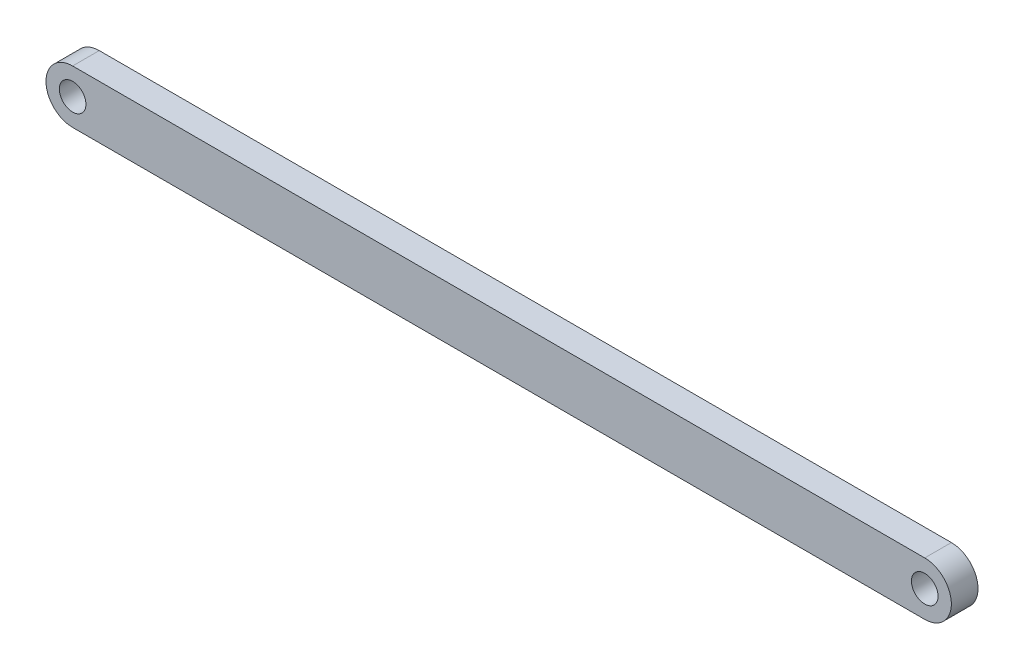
from build123d import *

# Parameters (mm, degrees)
SKETCH1_R           = 1.5875
BOSS_EXTRUDE1_DEPTH = 3.175


with BuildPart() as part:
    # Sketch1 → Boss-Extrude1 (new body)
    with BuildSketch(Plane.XY):
        with BuildLine():
            Line((0, 3.175), (101.6, 3.175))
            ThreePointArc((101.6, 3.175), (104.775, 0), (101.6, -3.175))
            Line((101.6, -3.175), (0, -3.175))
            ThreePointArc((0, -3.175), (-3.175, 0), (0, 3.175))
        make_face()
        Circle(SKETCH1_R, mode=Mode.SUBTRACT)
        with Locations((101.6, 0)):
            Circle(SKETCH1_R, mode=Mode.SUBTRACT)
    extrude(amount=BOSS_EXTRUDE1_DEPTH)


solid = part.part
